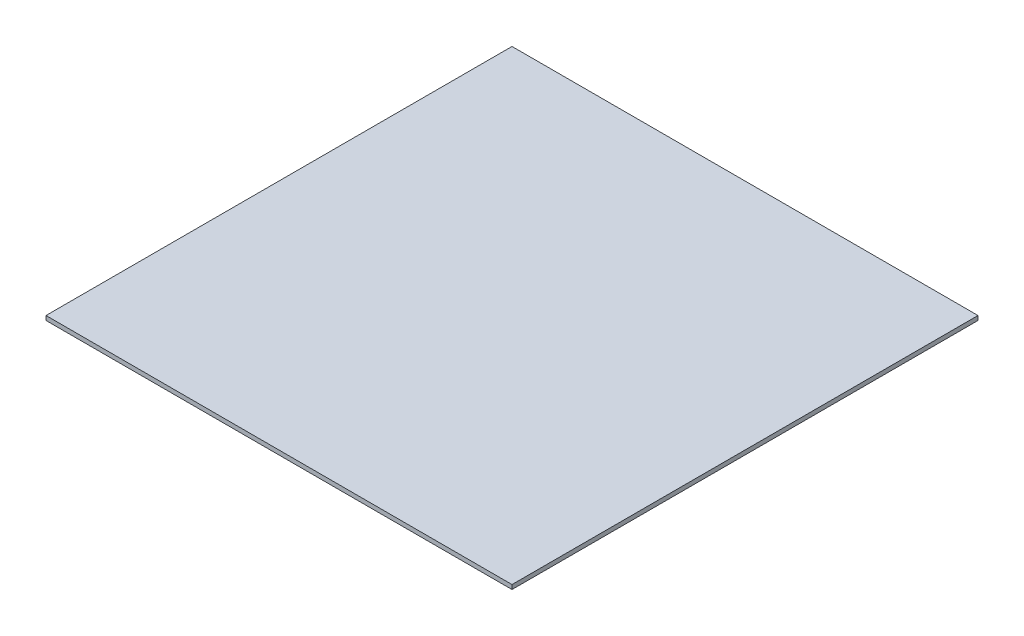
from build123d import *

# Parameters (mm, degrees)
SKETCH1_W           = 430
SKETCH1_H           = 430
BOSS_EXTRUDE1_DEPTH = 4


with BuildPart() as part:
    # Sketch1 → Boss-Extrude1 (new body)
    with BuildSketch(Plane(origin=(0, 0, 0), x_dir=(1, 0, 0), z_dir=(0, 1, 0))):
        Rectangle(SKETCH1_W, SKETCH1_H)
    extrude(amount=BOSS_EXTRUDE1_DEPTH)


solid = part.part
